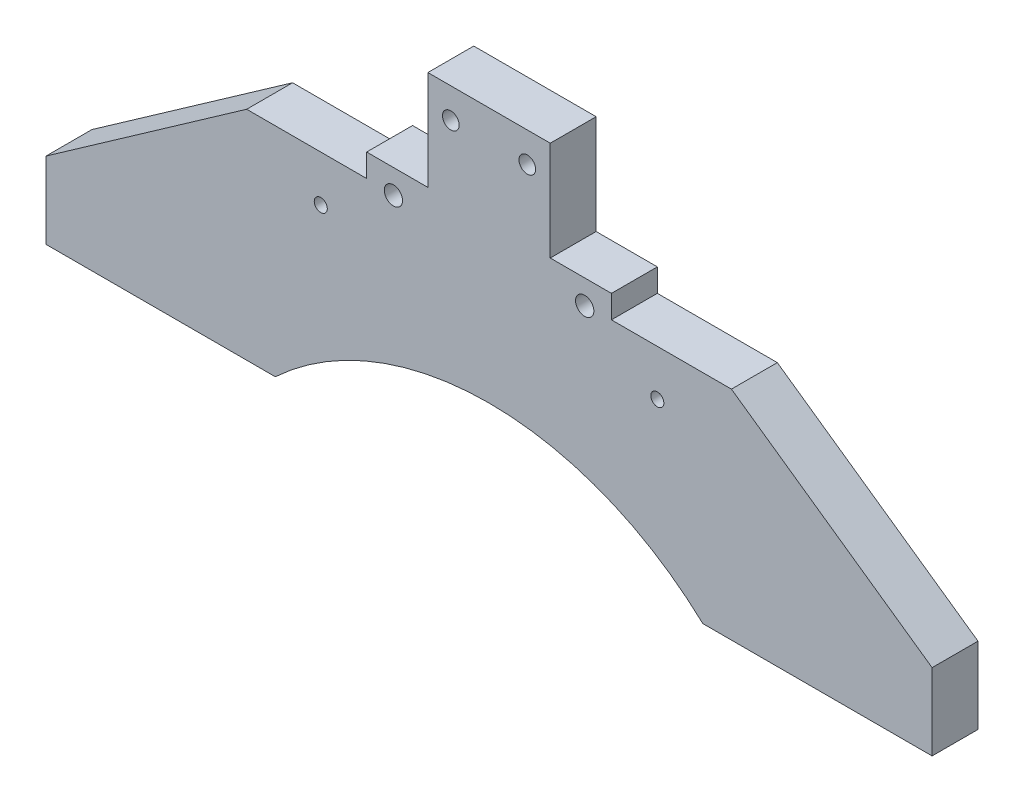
from build123d import *

# Parameters (mm, degrees)
BOSS_EXTRUDE1_DEPTH                            = 9.525
BOSS_EXTRUDE2_START                            = -6.35
BOSS_EXTRUDE2_DEPTH                            = 6.35
F_8_32_TAPPED_HOLE6_D                          = 3.4544
CBORE_FOR_6_SOCKET_HEAD_CAP_SCREW1_D           = 3.7973
CBORE_FOR_6_SOCKET_HEAD_CAP_SCREW1_CBORE_D     = 7.14502
CBORE_FOR_6_SOCKET_HEAD_CAP_SCREW1_CBORE_DEPTH = 3.5052
F_6_32_TAPPED_HOLE2_D                          = 2.7051
F_6_32_TAPPED_HOLE2_DEPTH                      = 10.9728
F_6_32_TAPPED_HOLE2_TIP                        = 0.81269403


with BuildPart() as part:
    # Sketch1 → Boss-Extrude1 (new body)
    with BuildSketch(Plane.XY):
        with BuildLine():
            Line((54.306655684, 0), (91.948, 0))
            Line((91.948, 0), (91.948, 15.875))
            Line((91.948, 15.875), (50.300566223, 45.1104))
            Line((50.300566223, 45.1104), (25.4, 45.1104))
            Line((25.4, 45.1104), (25.4, 49.8729))
            Line((25.4, 49.8729), (12.7, 49.8729))
            Line((12.7, 49.8729), (12.7, 70.5104))
            Line((12.7, 70.5104), (-12.7, 70.5104))
            Line((-12.7, 70.5104), (-12.7, 49.8729))
            Line((-12.7, 49.8729), (-25.4, 49.8729))
            Line((-25.4, 49.8729), (-25.4, 45.1104))
            Line((-25.4, 45.1104), (-50.300566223, 45.1104))
            Line((-50.300566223, 45.1104), (-91.948, 15.875))
            Line((-91.948, 15.875), (-91.948, 0))
            Line((-91.948, 0), (-54.306655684, 0))
            ThreePointArc((-54.306655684, 0), (0, 24.60625), (54.306655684, 0))
        make_face()
    extrude(amount=BOSS_EXTRUDE1_DEPTH)

    # Sketch7 → Boss-Extrude2 (add)
    with BuildSketch(Plane.XY.offset(9.525).offset(BOSS_EXTRUDE2_START)):
        with BuildLine():
            Line((54.306655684, 0), (44.364873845, 0))
            ThreePointArc((44.364873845, 0), (0, 17.4625), (-44.364873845, 0))
            Line((-44.364873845, 0), (-54.306655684, 0))
            ThreePointArc((-54.306655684, 0), (0, 24.60625), (54.306655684, 0))
        make_face()
    extrude(amount=BOSS_EXTRUDE2_DEPTH)

    # 8-32 Tapped Hole6 (through all)
    with Locations(Plane.XY.offset(9.525)):
        with Locations((-7.9375, 64.2874), (7.9375, 64.2874)):
            Hole(F_8_32_TAPPED_HOLE6_D / 2)

    # CBORE for _6 Socket Head Cap Screw1 (through all)
    with Locations(Plane(origin=(0, 0, 0), x_dir=(-1, 0, 0), z_dir=(0, 0, -1))):
        with Locations((-19.8501, 44.8564), (19.8501, 44.8564)):
            CounterBoreHole(CBORE_FOR_6_SOCKET_HEAD_CAP_SCREW1_D / 2, CBORE_FOR_6_SOCKET_HEAD_CAP_SCREW1_CBORE_D / 2, CBORE_FOR_6_SOCKET_HEAD_CAP_SCREW1_CBORE_DEPTH)

    # 6-32 Tapped Hole2
    with Locations(Plane(origin=(0, 0, 0), x_dir=(-1, 0, 0), z_dir=(0, 0, -1))):
        with Locations((-34.925, 35.5854), (34.925, 35.5854)):
            Hole(F_6_32_TAPPED_HOLE2_D / 2, depth=F_6_32_TAPPED_HOLE2_DEPTH)
            with Locations((0, 0, -(F_6_32_TAPPED_HOLE2_DEPTH + F_6_32_TAPPED_HOLE2_TIP / 2))):  # 118° drill point
                Cone(0, F_6_32_TAPPED_HOLE2_D / 2, F_6_32_TAPPED_HOLE2_TIP, mode=Mode.SUBTRACT)


solid = part.part
